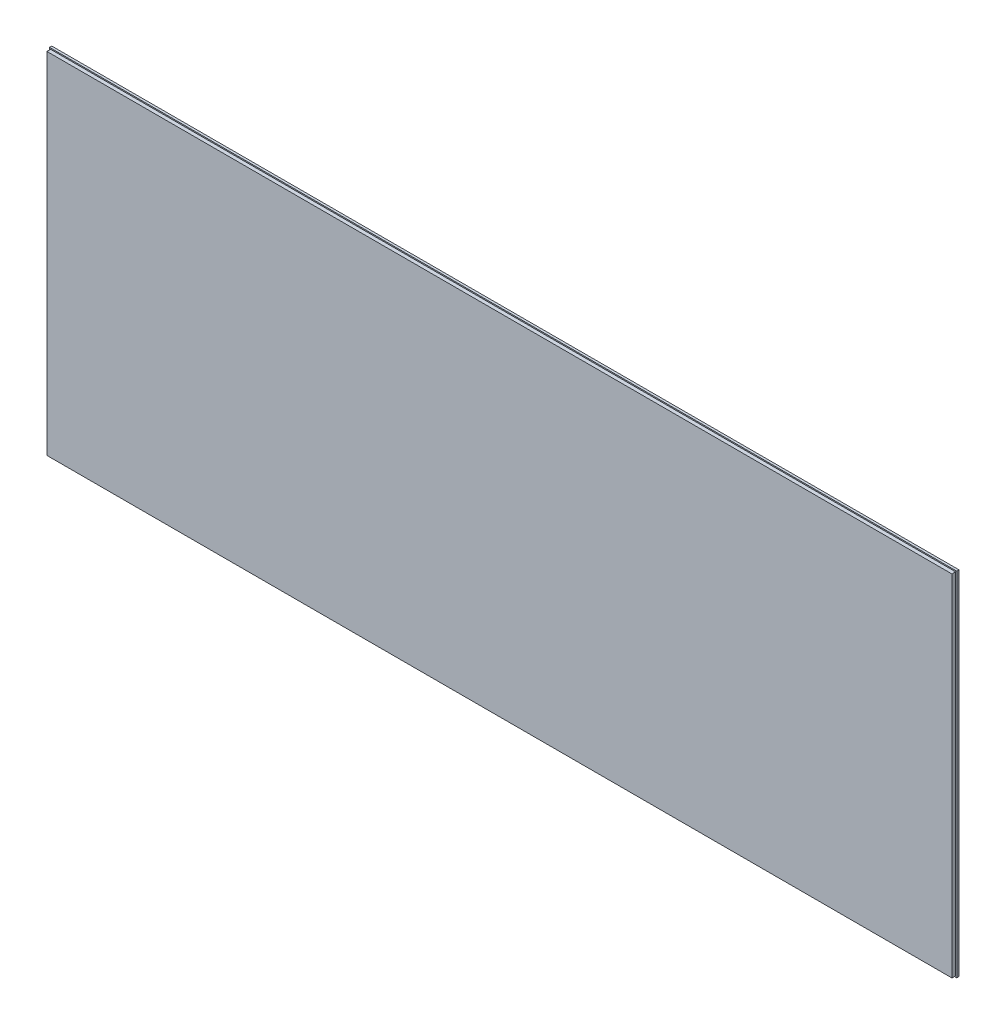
ISO-10303-21;
HEADER;
FILE_DESCRIPTION(('STEP AP214'),'2;1');
FILE_NAME('part.step','',(''),(''),'','','');
FILE_SCHEMA(('AUTOMOTIVE_DESIGN { 1 0 10303 214 1 1 1 1 }'));
ENDSEC;
DATA;
#1=APPLICATION_CONTEXT('core data for automotive mechanical design processes');
#2=APPLICATION_PROTOCOL_DEFINITION('international standard','automotive_design',2000,#1);
#3=PRODUCT_CONTEXT('',#1,'mechanical');
#4=PRODUCT('Part','Part','',(#3));
#5=PRODUCT_RELATED_PRODUCT_CATEGORY('part','',(#4));
#6=PRODUCT_DEFINITION_FORMATION('','',#4);
#7=PRODUCT_DEFINITION_CONTEXT('part definition',#1,'design');
#8=PRODUCT_DEFINITION('design','',#6,#7);
#9=PRODUCT_DEFINITION_SHAPE('','',#8);
#10=(LENGTH_UNIT() NAMED_UNIT(*) SI_UNIT(.MILLI.,.METRE.));
#11=(NAMED_UNIT(*) PLANE_ANGLE_UNIT() SI_UNIT($,.RADIAN.));
#12=(NAMED_UNIT(*) SI_UNIT($,.STERADIAN.) SOLID_ANGLE_UNIT());
#13=UNCERTAINTY_MEASURE_WITH_UNIT(LENGTH_MEASURE(1.E-05),#10,'distance_accuracy_value','');
#14=(GEOMETRIC_REPRESENTATION_CONTEXT(3) GLOBAL_UNCERTAINTY_ASSIGNED_CONTEXT((#13)) GLOBAL_UNIT_ASSIGNED_CONTEXT((#10,
#11,#12)) REPRESENTATION_CONTEXT('',''));
#15=CARTESIAN_POINT('',(0.,0.,0.));
#16=DIRECTION('',(0.,0.,1.));
#17=DIRECTION('',(1.,0.,0.));
#18=AXIS2_PLACEMENT_3D('',#15,#16,#17);
#19=CARTESIAN_POINT('',(988.,-383.5,13.));
#20=DIRECTION('',(-1.,0.,0.));
#21=DIRECTION('',(0.,0.,1.));
#22=AXIS2_PLACEMENT_3D('',#19,#20,#21);
#23=PLANE('',#22);
#24=DIRECTION('',(0.,-1.,0.));
#25=VECTOR('',#24,1.);
#26=CARTESIAN_POINT('',(988.,383.5,5.));
#27=LINE('',#26,#25);
#28=CARTESIAN_POINT('',(988.,383.5,5.));
#29=VERTEX_POINT('',#28);
#30=CARTESIAN_POINT('',(988.,-383.5,5.));
#31=VERTEX_POINT('',#30);
#32=EDGE_CURVE('E127',#29,#31,#27,.T.);
#33=ORIENTED_EDGE('',*,*,#32,.T.);
#34=DIRECTION('',(0.,0.,-1.));
#35=VECTOR('',#34,1.);
#36=CARTESIAN_POINT('',(988.,-383.5,13.));
#37=LINE('',#36,#35);
#38=CARTESIAN_POINT('',(988.,-383.5,0.));
#39=VERTEX_POINT('',#38);
#40=EDGE_CURVE('E55',#31,#39,#37,.T.);
#41=ORIENTED_EDGE('',*,*,#40,.T.);
#42=DIRECTION('',(0.,1.,0.));
#43=VECTOR('',#42,1.);
#44=CARTESIAN_POINT('',(988.,-383.5,0.));
#45=LINE('',#44,#43);
#46=CARTESIAN_POINT('',(988.,383.5,0.));
#47=VERTEX_POINT('',#46);
#48=EDGE_CURVE('E133',#39,#47,#45,.T.);
#49=ORIENTED_EDGE('',*,*,#48,.T.);
#50=DIRECTION('',(0.,0.,-1.));
#51=VECTOR('',#50,1.);
#52=CARTESIAN_POINT('',(988.,383.5,13.));
#53=LINE('',#52,#51);
#54=EDGE_CURVE('E11',#29,#47,#53,.T.);
#55=ORIENTED_EDGE('',*,*,#54,.F.);
#56=EDGE_LOOP('',(#33,#41,#49,#55));
#57=FACE_BOUND('',#56,.T.);
#58=ADVANCED_FACE('F33',(#57),#23,.F.);
#59=CARTESIAN_POINT('',(0.,0.,13.));
#60=DIRECTION('',(0.,0.,-1.));
#61=DIRECTION('',(-1.,0.,0.));
#62=AXIS2_PLACEMENT_3D('',#59,#60,#61);
#63=PLANE('',#62);
#64=DIRECTION('',(0.,-1.,0.));
#65=VECTOR('',#64,1.);
#66=CARTESIAN_POINT('',(985.5,383.5,12.9999999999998));
#67=LINE('',#66,#65);
#68=CARTESIAN_POINT('',(985.5,381.,12.9999999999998));
#69=VERTEX_POINT('',#68);
#70=CARTESIAN_POINT('',(985.5,-381.,13.));
#71=VERTEX_POINT('',#70);
#72=EDGE_CURVE('E47',#69,#71,#67,.T.);
#73=ORIENTED_EDGE('',*,*,#72,.F.);
#74=DIRECTION('',(-1.,0.,0.));
#75=VECTOR('',#74,1.);
#76=CARTESIAN_POINT('',(988.,381.,13.));
#77=LINE('',#76,#75);
#78=CARTESIAN_POINT('',(-985.5,381.,12.9999999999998));
#79=VERTEX_POINT('',#78);
#80=EDGE_CURVE('E131',#69,#79,#77,.T.);
#81=ORIENTED_EDGE('',*,*,#80,.T.);
#82=DIRECTION('',(0.,-1.,0.));
#83=VECTOR('',#82,1.);
#84=CARTESIAN_POINT('',(-985.5,383.5,12.9999999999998));
#85=LINE('',#84,#83);
#86=CARTESIAN_POINT('',(-985.5,-381.,12.9999999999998));
#87=VERTEX_POINT('',#86);
#88=EDGE_CURVE('E271',#79,#87,#85,.T.);
#89=ORIENTED_EDGE('',*,*,#88,.T.);
#90=DIRECTION('',(-1.,0.,0.));
#91=VECTOR('',#90,1.);
#92=CARTESIAN_POINT('',(988.,-381.,13.));
#93=LINE('',#92,#91);
#94=EDGE_CURVE('E118',#71,#87,#93,.T.);
#95=ORIENTED_EDGE('',*,*,#94,.F.);
#96=EDGE_LOOP('',(#73,#81,#89,#95));
#97=FACE_BOUND('',#96,.T.);
#98=ADVANCED_FACE('F166',(#97),#63,.F.);
#99=CARTESIAN_POINT('',(988.,381.,5.));
#100=DIRECTION('',(0.,-1.,0.));
#101=DIRECTION('',(0.,0.,-1.));
#102=AXIS2_PLACEMENT_3D('',#99,#100,#101);
#103=PLANE('',#102);
#104=DIRECTION('',(0.,0.,1.));
#105=VECTOR('',#104,1.);
#106=CARTESIAN_POINT('',(985.5,381.,5.));
#107=LINE('',#106,#105);
#108=CARTESIAN_POINT('',(985.5,381.,5.));
#109=VERTEX_POINT('',#108);
#110=EDGE_CURVE('E106',#109,#69,#107,.T.);
#111=ORIENTED_EDGE('',*,*,#110,.F.);
#112=DIRECTION('',(-1.,0.,0.));
#113=VECTOR('',#112,1.);
#114=CARTESIAN_POINT('',(988.,381.,5.));
#115=LINE('',#114,#113);
#116=CARTESIAN_POINT('',(-985.5,381.,5.));
#117=VERTEX_POINT('',#116);
#118=EDGE_CURVE('E104',#109,#117,#115,.T.);
#119=ORIENTED_EDGE('',*,*,#118,.T.);
#120=DIRECTION('',(0.,0.,1.));
#121=VECTOR('',#120,1.);
#122=CARTESIAN_POINT('',(-985.5,381.,5.));
#123=LINE('',#122,#121);
#124=EDGE_CURVE('E123',#117,#79,#123,.T.);
#125=ORIENTED_EDGE('',*,*,#124,.T.);
#126=ORIENTED_EDGE('',*,*,#80,.F.);
#127=EDGE_LOOP('',(#111,#119,#125,#126));
#128=FACE_BOUND('',#127,.T.);
#129=ADVANCED_FACE('F170',(#128),#103,.F.);
#130=CARTESIAN_POINT('',(988.,-381.,5.));
#131=DIRECTION('',(0.,-1.,0.));
#132=DIRECTION('',(0.,0.,-1.));
#133=AXIS2_PLACEMENT_3D('',#130,#131,#132);
#134=PLANE('',#133);
#135=DIRECTION('',(-1.,0.,0.));
#136=VECTOR('',#135,1.);
#137=CARTESIAN_POINT('',(988.,-381.,5.));
#138=LINE('',#137,#136);
#139=CARTESIAN_POINT('',(985.5,-381.,5.));
#140=VERTEX_POINT('',#139);
#141=CARTESIAN_POINT('',(-985.5,-381.,5.));
#142=VERTEX_POINT('',#141);
#143=EDGE_CURVE('E102',#140,#142,#138,.T.);
#144=ORIENTED_EDGE('',*,*,#143,.F.);
#145=DIRECTION('',(0.,0.,1.));
#146=VECTOR('',#145,1.);
#147=CARTESIAN_POINT('',(985.5,-381.,12.9999999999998));
#148=LINE('',#147,#146);
#149=EDGE_CURVE('E108',#140,#71,#148,.T.);
#150=ORIENTED_EDGE('',*,*,#149,.T.);
#151=ORIENTED_EDGE('',*,*,#94,.T.);
#152=DIRECTION('',(0.,0.,1.));
#153=VECTOR('',#152,1.);
#154=CARTESIAN_POINT('',(-985.5,-381.,12.9999999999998));
#155=LINE('',#154,#153);
#156=EDGE_CURVE('E116',#142,#87,#155,.T.);
#157=ORIENTED_EDGE('',*,*,#156,.F.);
#158=EDGE_LOOP('',(#144,#150,#151,#157));
#159=FACE_BOUND('',#158,.T.);
#160=ADVANCED_FACE('F114',(#159),#134,.T.);
#161=CARTESIAN_POINT('',(-988.,-383.5,13.));
#162=DIRECTION('',(1.,0.,0.));
#163=DIRECTION('',(0.,0.,-1.));
#164=AXIS2_PLACEMENT_3D('',#161,#162,#163);
#165=PLANE('',#164);
#166=DIRECTION('',(0.,0.,-1.));
#167=VECTOR('',#166,1.);
#168=CARTESIAN_POINT('',(-988.,-383.5,13.));
#169=LINE('',#168,#167);
#170=CARTESIAN_POINT('',(-988.,-383.5,5.));
#171=VERTEX_POINT('',#170);
#172=CARTESIAN_POINT('',(-988.,-383.5,0.));
#173=VERTEX_POINT('',#172);
#174=EDGE_CURVE('E146',#171,#173,#169,.T.);
#175=ORIENTED_EDGE('',*,*,#174,.F.);
#176=DIRECTION('',(0.,-1.,0.));
#177=VECTOR('',#176,1.);
#178=CARTESIAN_POINT('',(-988.,383.5,5.));
#179=LINE('',#178,#177);
#180=CARTESIAN_POINT('',(-988.,383.5,5.));
#181=VERTEX_POINT('',#180);
#182=EDGE_CURVE('E121',#181,#171,#179,.T.);
#183=ORIENTED_EDGE('',*,*,#182,.F.);
#184=DIRECTION('',(0.,0.,-1.));
#185=VECTOR('',#184,1.);
#186=CARTESIAN_POINT('',(-988.,383.5,13.));
#187=LINE('',#186,#185);
#188=CARTESIAN_POINT('',(-988.,383.5,0.));
#189=VERTEX_POINT('',#188);
#190=EDGE_CURVE('E40',#181,#189,#187,.T.);
#191=ORIENTED_EDGE('',*,*,#190,.T.);
#192=DIRECTION('',(0.,-1.,0.));
#193=VECTOR('',#192,1.);
#194=CARTESIAN_POINT('',(-988.,-383.5,0.));
#195=LINE('',#194,#193);
#196=EDGE_CURVE('E140',#189,#173,#195,.T.);
#197=ORIENTED_EDGE('',*,*,#196,.T.);
#198=EDGE_LOOP('',(#175,#183,#191,#197));
#199=FACE_BOUND('',#198,.T.);
#200=ADVANCED_FACE('F151',(#199),#165,.F.);
#201=CARTESIAN_POINT('',(-988.,-383.5,13.));
#202=DIRECTION('',(0.,1.,0.));
#203=DIRECTION('',(0.,0.,1.));
#204=AXIS2_PLACEMENT_3D('',#201,#202,#203);
#205=PLANE('',#204);
#206=DIRECTION('',(-1.,0.,0.));
#207=VECTOR('',#206,1.);
#208=CARTESIAN_POINT('',(988.,-383.5,5.));
#209=LINE('',#208,#207);
#210=EDGE_CURVE('E117',#31,#171,#209,.T.);
#211=ORIENTED_EDGE('',*,*,#210,.T.);
#212=ORIENTED_EDGE('',*,*,#174,.T.);
#213=DIRECTION('',(1.,0.,0.));
#214=VECTOR('',#213,1.);
#215=CARTESIAN_POINT('',(-988.,-383.5,0.));
#216=LINE('',#215,#214);
#217=EDGE_CURVE('E143',#173,#39,#216,.T.);
#218=ORIENTED_EDGE('',*,*,#217,.T.);
#219=ORIENTED_EDGE('',*,*,#40,.F.);
#220=EDGE_LOOP('',(#211,#212,#218,#219));
#221=FACE_BOUND('',#220,.T.);
#222=ADVANCED_FACE('F163',(#221),#205,.F.);
#223=CARTESIAN_POINT('',(-988.,383.5,13.));
#224=DIRECTION('',(0.,-1.,0.));
#225=DIRECTION('',(0.,0.,-1.));
#226=AXIS2_PLACEMENT_3D('',#223,#224,#225);
#227=PLANE('',#226);
#228=ORIENTED_EDGE('',*,*,#190,.F.);
#229=DIRECTION('',(-1.,0.,0.));
#230=VECTOR('',#229,1.);
#231=CARTESIAN_POINT('',(988.,383.5,5.));
#232=LINE('',#231,#230);
#233=EDGE_CURVE('E129',#29,#181,#232,.T.);
#234=ORIENTED_EDGE('',*,*,#233,.F.);
#235=ORIENTED_EDGE('',*,*,#54,.T.);
#236=DIRECTION('',(-1.,0.,0.));
#237=VECTOR('',#236,1.);
#238=CARTESIAN_POINT('',(-988.,383.5,0.));
#239=LINE('',#238,#237);
#240=EDGE_CURVE('E137',#47,#189,#239,.T.);
#241=ORIENTED_EDGE('',*,*,#240,.T.);
#242=EDGE_LOOP('',(#228,#234,#235,#241));
#243=FACE_BOUND('',#242,.T.);
#244=ADVANCED_FACE('F157',(#243),#227,.F.);
#245=CARTESIAN_POINT('',(0.,0.,0.));
#246=DIRECTION('',(0.,0.,-1.));
#247=DIRECTION('',(-1.,0.,0.));
#248=AXIS2_PLACEMENT_3D('',#245,#246,#247);
#249=PLANE('',#248);
#250=ORIENTED_EDGE('',*,*,#48,.F.);
#251=ORIENTED_EDGE('',*,*,#217,.F.);
#252=ORIENTED_EDGE('',*,*,#196,.F.);
#253=ORIENTED_EDGE('',*,*,#240,.F.);
#254=EDGE_LOOP('',(#250,#251,#252,#253));
#255=FACE_BOUND('',#254,.T.);
#256=ADVANCED_FACE('F161',(#255),#249,.T.);
#257=CARTESIAN_POINT('',(988.,383.5,5.));
#258=DIRECTION('',(0.,0.,-1.));
#259=DIRECTION('',(-1.,0.,0.));
#260=AXIS2_PLACEMENT_3D('',#257,#258,#259);
#261=PLANE('',#260);
#262=ORIENTED_EDGE('',*,*,#118,.F.);
#263=DIRECTION('',(0.,-1.,0.));
#264=VECTOR('',#263,1.);
#265=CARTESIAN_POINT('',(985.5,383.5,5.));
#266=LINE('',#265,#264);
#267=EDGE_CURVE('E97',#109,#140,#266,.T.);
#268=ORIENTED_EDGE('',*,*,#267,.T.);
#269=ORIENTED_EDGE('',*,*,#143,.T.);
#270=DIRECTION('',(0.,-1.,0.));
#271=VECTOR('',#270,1.);
#272=CARTESIAN_POINT('',(-985.5,383.5,5.));
#273=LINE('',#272,#271);
#274=EDGE_CURVE('E267',#117,#142,#273,.T.);
#275=ORIENTED_EDGE('',*,*,#274,.F.);
#276=EDGE_LOOP('',(#262,#268,#269,#275));
#277=FACE_BOUND('',#276,.T.);
#278=ORIENTED_EDGE('',*,*,#233,.T.);
#279=ORIENTED_EDGE('',*,*,#182,.T.);
#280=ORIENTED_EDGE('',*,*,#210,.F.);
#281=ORIENTED_EDGE('',*,*,#32,.F.);
#282=EDGE_LOOP('',(#278,#279,#280,#281));
#283=FACE_BOUND('',#282,.T.);
#284=ADVANCED_FACE('F98',(#277,#283),#261,.F.);
#285=CARTESIAN_POINT('',(-985.5,383.5,12.9999999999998));
#286=DIRECTION('',(1.,0.,0.));
#287=DIRECTION('',(0.,0.,-1.));
#288=AXIS2_PLACEMENT_3D('',#285,#286,#287);
#289=PLANE('',#288);
#290=ORIENTED_EDGE('',*,*,#274,.T.);
#291=ORIENTED_EDGE('',*,*,#156,.T.);
#292=ORIENTED_EDGE('',*,*,#88,.F.);
#293=ORIENTED_EDGE('',*,*,#124,.F.);
#294=EDGE_LOOP('',(#290,#291,#292,#293));
#295=FACE_BOUND('',#294,.T.);
#296=ADVANCED_FACE('F201',(#295),#289,.F.);
#297=CARTESIAN_POINT('',(985.5,383.5,12.9999999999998));
#298=DIRECTION('',(1.,0.,0.));
#299=DIRECTION('',(0.,0.,-1.));
#300=AXIS2_PLACEMENT_3D('',#297,#298,#299);
#301=PLANE('',#300);
#302=ORIENTED_EDGE('',*,*,#110,.T.);
#303=ORIENTED_EDGE('',*,*,#72,.T.);
#304=ORIENTED_EDGE('',*,*,#149,.F.);
#305=ORIENTED_EDGE('',*,*,#267,.F.);
#306=EDGE_LOOP('',(#302,#303,#304,#305));
#307=FACE_BOUND('',#306,.T.);
#308=ADVANCED_FACE('F109',(#307),#301,.T.);
#309=CLOSED_SHELL('',(#58,#98,#129,#160,#200,#222,#244,#256,#284,#296,#308));
#310=MANIFOLD_SOLID_BREP('B2',#309);
#311=ADVANCED_BREP_SHAPE_REPRESENTATION('',(#18,#310),#14);
#312=SHAPE_DEFINITION_REPRESENTATION(#9,#311);
ENDSEC;
END-ISO-10303-21;
